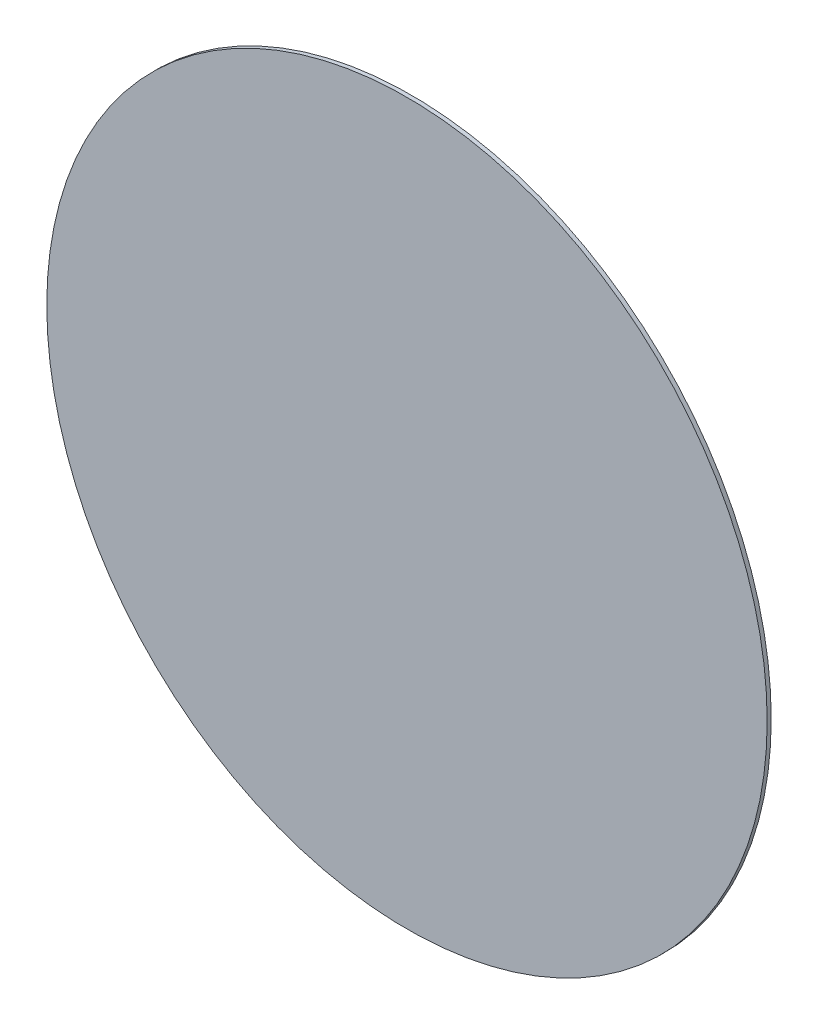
from build123d import *

# Parameters (mm, degrees)
ESQUISSE1_R        = 178
BOSS_EXTRU_1_DEPTH = 2


with BuildPart() as part:
    # Esquisse1 → Boss.-Extru.1 (new body)
    with BuildSketch(Plane.XY):
        Circle(ESQUISSE1_R)
    extrude(amount=BOSS_EXTRU_1_DEPTH)


solid = part.part
